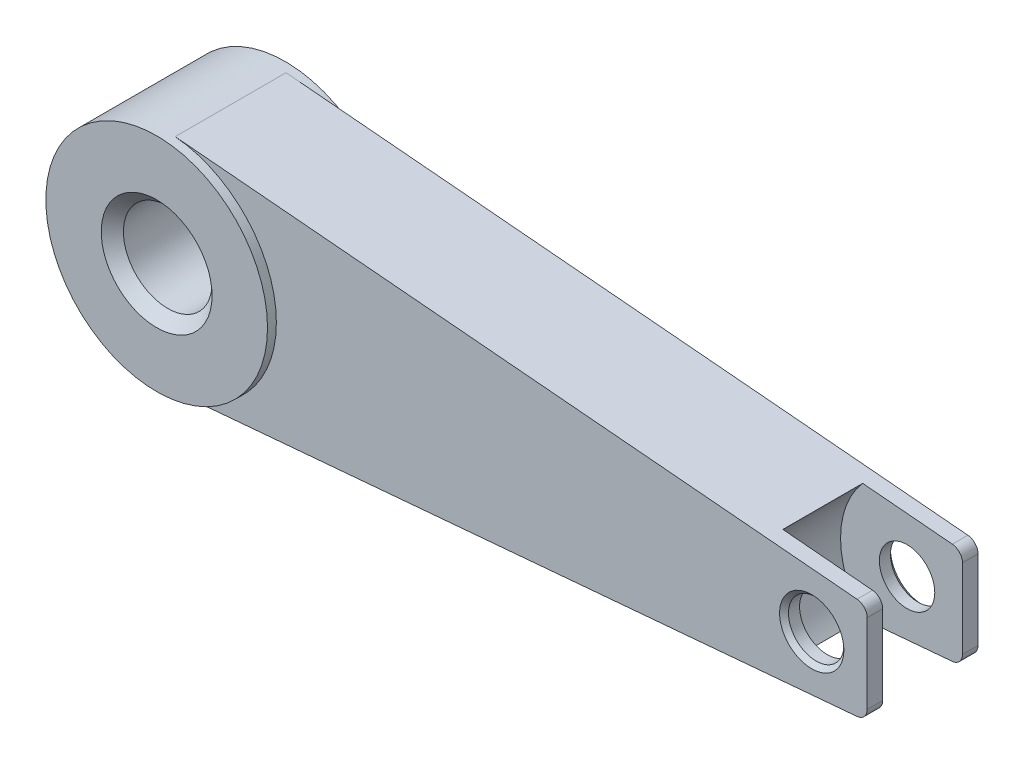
from build123d import *

# Parameters (mm, degrees)
IZIM1_R                          = 5
Y_KSEKLIK_EKSTR_ZYON1_DEPTH      = 5.8
Y_KSEKLIK_EKSTR_ZYON2_DEPTH      = 2.5
Y_KSEKLIK_EKSTR_ZYON2_DEPTH_BACK = 2.5
IZIM3_R                          = 2
KES_EKSTR_ZYON1_DEPTH            = 12.5
PAH1_SIZE                        = 0.5
KES_EKSTR_ZYON2_DEPTH            = 1.8
KES_EKSTR_ZYON2_DEPTH_BACK       = 1.8
IZIM4_R                          = 4
IZIM5_R                          = 1.25
KES_EKSTR_ZYON3_DEPTH            = 6.8
PAH2_SIZE                        = 0.2
RADYUS1_R                        = 0.5


with BuildPart() as part:
    # izim1 → Y_kseklik-Ekstr_zyon1 (new body)
    with BuildSketch(Plane.XY):
        Circle(IZIM1_R)
    extrude(amount=Y_KSEKLIK_EKSTR_ZYON1_DEPTH)

    # izim2 → Y_kseklik-Ekstr_zyon2 (add, two sides: drawn at the far end of the back side and taken through both)
    with BuildSketch(Plane.XY.offset(2.9).offset(-Y_KSEKLIK_EKSTR_ZYON2_DEPTH_BACK)):
        with BuildLine():
            Line((0.435778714, 4.98097349), (31.650948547, 2.25))
            Line((31.650948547, 2.25), (31.650948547, -2.25))
            Line((31.650948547, -2.25), (0.435778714, -4.98097349))
            ThreePointArc((0.435778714, -4.98097349), (-5, 0), (0.435778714, 4.98097349))
        make_face()
    extrude(amount=Y_KSEKLIK_EKSTR_ZYON2_DEPTH + Y_KSEKLIK_EKSTR_ZYON2_DEPTH_BACK)

    # izim3 → Kes-Ekstr_zyon1 (cut)
    with BuildSketch(Plane.XY.offset(5.8)):
        Circle(IZIM3_R)
    extrude(amount=-KES_EKSTR_ZYON1_DEPTH, mode=Mode.SUBTRACT)

    # Pah1
    pah1_edges = [part.edges().sort_by_distance(p)[0] for p in [
        (-2, 0, 0),
        (-2, 0, 5.8),
    ]]
    chamfer(pah1_edges, length=PAH1_SIZE)

    # izim4 → Kes-Ekstr_zyon2 (cut, two sides: drawn at the far end of the back side and taken through both)
    with BuildSketch(Plane.XY.offset(2.9).offset(-KES_EKSTR_ZYON2_DEPTH_BACK)):
        with Locations((30.150948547, 0)):
            Circle(IZIM4_R)
    extrude(amount=KES_EKSTR_ZYON2_DEPTH + KES_EKSTR_ZYON2_DEPTH_BACK, mode=Mode.SUBTRACT)

    # izim5 → Kes-Ekstr_zyon3 (cut)
    with BuildSketch(Plane.XY.offset(5.4)):
        with Locations((29.150948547, 0)):
            Circle(IZIM5_R)
    extrude(amount=-KES_EKSTR_ZYON3_DEPTH, mode=Mode.SUBTRACT)

    # Pah2
    pah2_edges = [part.edges().sort_by_distance(p)[0] for p in [
        (27.900948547, 0, 0.4),
        (27.900948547, 0, 5.4),
    ]]
    chamfer(pah2_edges, length=PAH2_SIZE)

    # Radyus1
    radyus1_edges = [part.edges().sort_by_distance(p)[0] for p in [
        (31.650948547, -2.25, 5.05),
        (31.650948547, 2.25, 5.05),
        (31.650948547, 2.25, 0.75),
        (31.650948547, -2.25, 0.75),
    ]]
    fillet(radyus1_edges, radius=RADYUS1_R)


solid = part.part
